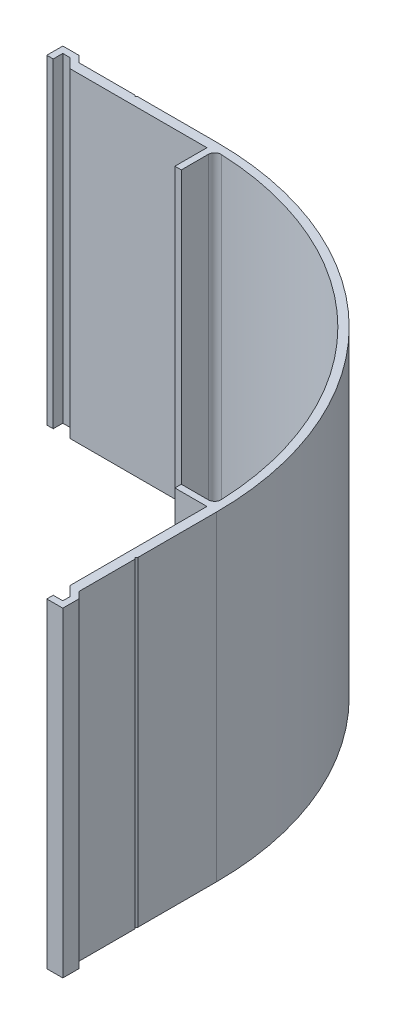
ISO-10303-21;
HEADER;
FILE_DESCRIPTION(('STEP AP214'),'2;1');
FILE_NAME('part.step','',(''),(''),'','','');
FILE_SCHEMA(('AUTOMOTIVE_DESIGN { 1 0 10303 214 1 1 1 1 }'));
ENDSEC;
DATA;
#1=APPLICATION_CONTEXT('core data for automotive mechanical design processes');
#2=APPLICATION_PROTOCOL_DEFINITION('international standard','automotive_design',2000,#1);
#3=PRODUCT_CONTEXT('',#1,'mechanical');
#4=PRODUCT('Part','Part','',(#3));
#5=PRODUCT_RELATED_PRODUCT_CATEGORY('part','',(#4));
#6=PRODUCT_DEFINITION_FORMATION('','',#4);
#7=PRODUCT_DEFINITION_CONTEXT('part definition',#1,'design');
#8=PRODUCT_DEFINITION('design','',#6,#7);
#9=PRODUCT_DEFINITION_SHAPE('','',#8);
#10=(LENGTH_UNIT() NAMED_UNIT(*) SI_UNIT(.MILLI.,.METRE.));
#11=(NAMED_UNIT(*) PLANE_ANGLE_UNIT() SI_UNIT($,.RADIAN.));
#12=(NAMED_UNIT(*) SI_UNIT($,.STERADIAN.) SOLID_ANGLE_UNIT());
#13=UNCERTAINTY_MEASURE_WITH_UNIT(LENGTH_MEASURE(1.E-05),#10,'distance_accuracy_value','');
#14=(GEOMETRIC_REPRESENTATION_CONTEXT(3) GLOBAL_UNCERTAINTY_ASSIGNED_CONTEXT((#13)) GLOBAL_UNIT_ASSIGNED_CONTEXT((#10,
#11,#12)) REPRESENTATION_CONTEXT('',''));
#15=CARTESIAN_POINT('',(0.,0.,0.));
#16=DIRECTION('',(0.,0.,1.));
#17=DIRECTION('',(1.,0.,0.));
#18=AXIS2_PLACEMENT_3D('',#15,#16,#17);
#19=CARTESIAN_POINT('',(-5.49256820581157E-12,50.,-1.99999999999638));
#20=DIRECTION('',(1.,0.,0.));
#21=DIRECTION('',(0.,0.,-1.));
#22=AXIS2_PLACEMENT_3D('',#19,#20,#21);
#23=PLANE('',#22);
#24=DIRECTION('',(0.,0.,1.));
#25=VECTOR('',#24,1.);
#26=CARTESIAN_POINT('',(-5.49256820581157E-12,-50.,-1.99999999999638));
#27=LINE('',#26,#25);
#28=CARTESIAN_POINT('',(-5.49256820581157E-12,-50.,-1.99999999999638));
#29=VERTEX_POINT('',#28);
#30=CARTESIAN_POINT('',(-5.49256820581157E-12,-50.,3.61979868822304E-12));
#31=VERTEX_POINT('',#30);
#32=EDGE_CURVE('E286',#29,#31,#27,.T.);
#33=ORIENTED_EDGE('',*,*,#32,.T.);
#34=DIRECTION('',(0.,-1.,0.));
#35=VECTOR('',#34,1.);
#36=CARTESIAN_POINT('',(-5.49256820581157E-12,50.,3.61979868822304E-12));
#37=LINE('',#36,#35);
#38=CARTESIAN_POINT('',(-5.49256820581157E-12,50.,3.61979868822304E-12));
#39=VERTEX_POINT('',#38);
#40=EDGE_CURVE('E11',#39,#31,#37,.T.);
#41=ORIENTED_EDGE('',*,*,#40,.F.);
#42=DIRECTION('',(0.,0.,1.));
#43=VECTOR('',#42,1.);
#44=CARTESIAN_POINT('',(-5.49256820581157E-12,50.,-1.99999999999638));
#45=LINE('',#44,#43);
#46=CARTESIAN_POINT('',(-5.49256820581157E-12,50.,-1.99999999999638));
#47=VERTEX_POINT('',#46);
#48=EDGE_CURVE('E352',#47,#39,#45,.T.);
#49=ORIENTED_EDGE('',*,*,#48,.F.);
#50=DIRECTION('',(0.,-1.,0.));
#51=VECTOR('',#50,1.);
#52=CARTESIAN_POINT('',(-5.49256820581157E-12,50.,-1.99999999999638));
#53=LINE('',#52,#51);
#54=EDGE_CURVE('E282',#47,#29,#53,.T.);
#55=ORIENTED_EDGE('',*,*,#54,.T.);
#56=EDGE_LOOP('',(#33,#41,#49,#55));
#57=FACE_BOUND('',#56,.T.);
#58=ADVANCED_FACE('F34',(#57),#23,.F.);
#59=CARTESIAN_POINT('',(4.99999999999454,50.,3.61979868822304E-12));
#60=DIRECTION('',(0.,0.,-1.));
#61=DIRECTION('',(-1.,0.,0.));
#62=AXIS2_PLACEMENT_3D('',#59,#60,#61);
#63=PLANE('',#62);
#64=DIRECTION('',(1.,0.,0.));
#65=VECTOR('',#64,1.);
#66=CARTESIAN_POINT('',(4.99999999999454,-50.,3.61979868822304E-12));
#67=LINE('',#66,#65);
#68=CARTESIAN_POINT('',(4.99999999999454,-50.,3.61979868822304E-12));
#69=VERTEX_POINT('',#68);
#70=EDGE_CURVE('E289',#31,#69,#67,.T.);
#71=ORIENTED_EDGE('',*,*,#70,.T.);
#72=DIRECTION('',(0.,-1.,0.));
#73=VECTOR('',#72,1.);
#74=CARTESIAN_POINT('',(4.99999999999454,50.,3.61979868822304E-12));
#75=LINE('',#74,#73);
#76=CARTESIAN_POINT('',(4.99999999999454,50.,3.61979868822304E-12));
#77=VERTEX_POINT('',#76);
#78=EDGE_CURVE('E42',#77,#69,#75,.T.);
#79=ORIENTED_EDGE('',*,*,#78,.F.);
#80=DIRECTION('',(1.,0.,0.));
#81=VECTOR('',#80,1.);
#82=CARTESIAN_POINT('',(4.99999999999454,50.,3.61979868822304E-12));
#83=LINE('',#82,#81);
#84=EDGE_CURVE('E171',#39,#77,#83,.T.);
#85=ORIENTED_EDGE('',*,*,#84,.F.);
#86=ORIENTED_EDGE('',*,*,#40,.T.);
#87=EDGE_LOOP('',(#71,#79,#85,#86));
#88=FACE_BOUND('',#87,.T.);
#89=ADVANCED_FACE('F540',(#88),#63,.F.);
#90=CARTESIAN_POINT('',(4.99999999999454,50.,-5.00000000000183));
#91=DIRECTION('',(-1.,0.,0.));
#92=DIRECTION('',(0.,0.,1.));
#93=AXIS2_PLACEMENT_3D('',#90,#91,#92);
#94=PLANE('',#93);
#95=DIRECTION('',(0.,0.,-1.));
#96=VECTOR('',#95,1.);
#97=CARTESIAN_POINT('',(4.99999999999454,-50.,-5.00000000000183));
#98=LINE('',#97,#96);
#99=CARTESIAN_POINT('',(4.99999999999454,-50.,-5.00000000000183));
#100=VERTEX_POINT('',#99);
#101=EDGE_CURVE('E291',#69,#100,#98,.T.);
#102=ORIENTED_EDGE('',*,*,#101,.T.);
#103=DIRECTION('',(0.,-1.,0.));
#104=VECTOR('',#103,1.);
#105=CARTESIAN_POINT('',(4.99999999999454,50.,-5.00000000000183));
#106=LINE('',#105,#104);
#107=CARTESIAN_POINT('',(4.99999999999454,50.,-5.00000000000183));
#108=VERTEX_POINT('',#107);
#109=EDGE_CURVE('E437',#108,#100,#106,.T.);
#110=ORIENTED_EDGE('',*,*,#109,.F.);
#111=DIRECTION('',(0.,0.,-1.));
#112=VECTOR('',#111,1.);
#113=CARTESIAN_POINT('',(4.99999999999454,50.,-5.00000000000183));
#114=LINE('',#113,#112);
#115=EDGE_CURVE('E445',#77,#108,#114,.T.);
#116=ORIENTED_EDGE('',*,*,#115,.F.);
#117=ORIENTED_EDGE('',*,*,#78,.T.);
#118=EDGE_LOOP('',(#102,#110,#116,#117));
#119=FACE_BOUND('',#118,.T.);
#120=ADVANCED_FACE('F443',(#119),#94,.F.);
#121=CARTESIAN_POINT('',(2.99999999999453,50.,-7.00000000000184));
#122=DIRECTION('',(-0.707106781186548,0.,0.707106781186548));
#123=DIRECTION('',(0.707106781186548,0.,0.707106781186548));
#124=AXIS2_PLACEMENT_3D('',#121,#122,#123);
#125=PLANE('',#124);
#126=DIRECTION('',(-0.707106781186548,0.,-0.707106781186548));
#127=VECTOR('',#126,1.);
#128=CARTESIAN_POINT('',(2.99999999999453,-50.,-7.00000000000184));
#129=LINE('',#128,#127);
#130=CARTESIAN_POINT('',(2.99999999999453,-50.,-7.00000000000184));
#131=VERTEX_POINT('',#130);
#132=EDGE_CURVE('E293',#100,#131,#129,.T.);
#133=ORIENTED_EDGE('',*,*,#132,.T.);
#134=DIRECTION('',(0.,-1.,0.));
#135=VECTOR('',#134,1.);
#136=CARTESIAN_POINT('',(2.99999999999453,50.,-7.00000000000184));
#137=LINE('',#136,#135);
#138=CARTESIAN_POINT('',(2.99999999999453,50.,-7.00000000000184));
#139=VERTEX_POINT('',#138);
#140=EDGE_CURVE('E434',#139,#131,#137,.T.);
#141=ORIENTED_EDGE('',*,*,#140,.F.);
#142=DIRECTION('',(-0.707106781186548,0.,-0.707106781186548));
#143=VECTOR('',#142,1.);
#144=CARTESIAN_POINT('',(2.99999999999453,50.,-7.00000000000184));
#145=LINE('',#144,#143);
#146=EDGE_CURVE('E463',#108,#139,#145,.T.);
#147=ORIENTED_EDGE('',*,*,#146,.F.);
#148=ORIENTED_EDGE('',*,*,#109,.T.);
#149=EDGE_LOOP('',(#133,#141,#147,#148));
#150=FACE_BOUND('',#149,.T.);
#151=ADVANCED_FACE('F454',(#150),#125,.F.);
#152=CARTESIAN_POINT('',(2.99999999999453,50.,-24.6000000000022));
#153=DIRECTION('',(-1.,0.,0.));
#154=DIRECTION('',(0.,0.,1.));
#155=AXIS2_PLACEMENT_3D('',#152,#153,#154);
#156=PLANE('',#155);
#157=DIRECTION('',(0.,0.,-1.));
#158=VECTOR('',#157,1.);
#159=CARTESIAN_POINT('',(2.99999999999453,-50.,-24.6000000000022));
#160=LINE('',#159,#158);
#161=CARTESIAN_POINT('',(2.99999999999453,-50.,-24.6000000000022));
#162=VERTEX_POINT('',#161);
#163=EDGE_CURVE('E295',#131,#162,#160,.T.);
#164=ORIENTED_EDGE('',*,*,#163,.T.);
#165=DIRECTION('',(0.,-1.,0.));
#166=VECTOR('',#165,1.);
#167=CARTESIAN_POINT('',(2.99999999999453,50.,-24.6000000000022));
#168=LINE('',#167,#166);
#169=CARTESIAN_POINT('',(2.99999999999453,50.,-24.6000000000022));
#170=VERTEX_POINT('',#169);
#171=EDGE_CURVE('E431',#170,#162,#168,.T.);
#172=ORIENTED_EDGE('',*,*,#171,.F.);
#173=DIRECTION('',(0.,0.,-1.));
#174=VECTOR('',#173,1.);
#175=CARTESIAN_POINT('',(2.99999999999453,50.,-24.6000000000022));
#176=LINE('',#175,#174);
#177=EDGE_CURVE('E460',#139,#170,#176,.T.);
#178=ORIENTED_EDGE('',*,*,#177,.F.);
#179=ORIENTED_EDGE('',*,*,#140,.T.);
#180=EDGE_LOOP('',(#164,#172,#178,#179));
#181=FACE_BOUND('',#180,.T.);
#182=ADVANCED_FACE('F458',(#181),#156,.F.);
#183=CARTESIAN_POINT('',(2.99999999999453,50.,-24.6000000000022));
#184=DIRECTION('',(-0.707106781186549,0.,0.707106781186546));
#185=DIRECTION('',(0.707106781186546,0.,0.707106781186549));
#186=AXIS2_PLACEMENT_3D('',#183,#184,#185);
#187=PLANE('',#186);
#188=DIRECTION('',(-0.707106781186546,0.,-0.707106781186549));
#189=VECTOR('',#188,1.);
#190=CARTESIAN_POINT('',(2.99999999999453,-50.,-24.6000000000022));
#191=LINE('',#190,#189);
#192=CARTESIAN_POINT('',(2.59999999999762,-50.,-24.9999999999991));
#193=VERTEX_POINT('',#192);
#194=EDGE_CURVE('E297',#162,#193,#191,.T.);
#195=ORIENTED_EDGE('',*,*,#194,.T.);
#196=DIRECTION('',(0.,-1.,0.));
#197=VECTOR('',#196,1.);
#198=CARTESIAN_POINT('',(2.59999999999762,50.,-24.9999999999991));
#199=LINE('',#198,#197);
#200=CARTESIAN_POINT('',(2.59999999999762,50.,-24.9999999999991));
#201=VERTEX_POINT('',#200);
#202=EDGE_CURVE('E428',#201,#193,#199,.T.);
#203=ORIENTED_EDGE('',*,*,#202,.F.);
#204=DIRECTION('',(-0.707106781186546,0.,-0.707106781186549));
#205=VECTOR('',#204,1.);
#206=CARTESIAN_POINT('',(2.99999999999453,50.,-24.6000000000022));
#207=LINE('',#206,#205);
#208=EDGE_CURVE('E462',#170,#201,#207,.T.);
#209=ORIENTED_EDGE('',*,*,#208,.F.);
#210=ORIENTED_EDGE('',*,*,#171,.T.);
#211=EDGE_LOOP('',(#195,#203,#209,#210));
#212=FACE_BOUND('',#211,.T.);
#213=ADVANCED_FACE('F553',(#212),#187,.F.);
#214=CARTESIAN_POINT('',(2.59999999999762,50.,-24.9999999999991));
#215=DIRECTION('',(-0.707106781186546,0.,-0.707106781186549));
#216=DIRECTION('',(-0.707106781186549,0.,0.707106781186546));
#217=AXIS2_PLACEMENT_3D('',#214,#215,#216);
#218=PLANE('',#217);
#219=DIRECTION('',(0.707106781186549,0.,-0.707106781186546));
#220=VECTOR('',#219,1.);
#221=CARTESIAN_POINT('',(2.59999999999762,-50.,-24.9999999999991));
#222=LINE('',#221,#220);
#223=CARTESIAN_POINT('',(2.99999999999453,-50.,-25.399999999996));
#224=VERTEX_POINT('',#223);
#225=EDGE_CURVE('E299',#193,#224,#222,.T.);
#226=ORIENTED_EDGE('',*,*,#225,.T.);
#227=DIRECTION('',(0.,-1.,0.));
#228=VECTOR('',#227,1.);
#229=CARTESIAN_POINT('',(2.99999999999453,50.,-25.399999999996));
#230=LINE('',#229,#228);
#231=CARTESIAN_POINT('',(2.99999999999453,50.,-25.399999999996));
#232=VERTEX_POINT('',#231);
#233=EDGE_CURVE('E425',#232,#224,#230,.T.);
#234=ORIENTED_EDGE('',*,*,#233,.F.);
#235=DIRECTION('',(0.707106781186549,0.,-0.707106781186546));
#236=VECTOR('',#235,1.);
#237=CARTESIAN_POINT('',(2.59999999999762,50.,-24.9999999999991));
#238=LINE('',#237,#236);
#239=EDGE_CURVE('E465',#201,#232,#238,.T.);
#240=ORIENTED_EDGE('',*,*,#239,.F.);
#241=ORIENTED_EDGE('',*,*,#202,.T.);
#242=EDGE_LOOP('',(#226,#234,#240,#241));
#243=FACE_BOUND('',#242,.T.);
#244=ADVANCED_FACE('F556',(#243),#218,.F.);
#245=CARTESIAN_POINT('',(2.99999999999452,50.,-49.9999999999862));
#246=DIRECTION('',(-1.,0.,0.));
#247=DIRECTION('',(0.,0.,1.));
#248=AXIS2_PLACEMENT_3D('',#245,#246,#247);
#249=PLANE('',#248);
#250=DIRECTION('',(0.,0.,-1.));
#251=VECTOR('',#250,1.);
#252=CARTESIAN_POINT('',(2.99999999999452,-50.,-49.9999999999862));
#253=LINE('',#252,#251);
#254=CARTESIAN_POINT('',(2.99999999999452,-50.,-49.9999999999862));
#255=VERTEX_POINT('',#254);
#256=EDGE_CURVE('E301',#224,#255,#253,.T.);
#257=ORIENTED_EDGE('',*,*,#256,.T.);
#258=DIRECTION('',(0.,-1.,0.));
#259=VECTOR('',#258,1.);
#260=CARTESIAN_POINT('',(2.99999999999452,50.,-49.9999999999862));
#261=LINE('',#260,#259);
#262=CARTESIAN_POINT('',(2.99999999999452,50.,-49.9999999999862));
#263=VERTEX_POINT('',#262);
#264=EDGE_CURVE('E422',#263,#255,#261,.T.);
#265=ORIENTED_EDGE('',*,*,#264,.F.);
#266=DIRECTION('',(0.,0.,-1.));
#267=VECTOR('',#266,1.);
#268=CARTESIAN_POINT('',(2.99999999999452,50.,-49.9999999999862));
#269=LINE('',#268,#267);
#270=EDGE_CURVE('E471',#232,#263,#269,.T.);
#271=ORIENTED_EDGE('',*,*,#270,.F.);
#272=ORIENTED_EDGE('',*,*,#233,.T.);
#273=EDGE_LOOP('',(#257,#265,#271,#272));
#274=FACE_BOUND('',#273,.T.);
#275=ADVANCED_FACE('F560',(#274),#249,.F.);
#276=CARTESIAN_POINT('',(-97.0000000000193,50.,-49.9999999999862));
#277=DIRECTION('',(0.,-1.,0.));
#278=DIRECTION('',(0.,0.,-1.));
#279=AXIS2_PLACEMENT_3D('',#276,#277,#278);
#280=CYLINDRICAL_SURFACE('',#279,100.000000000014);
#281=CARTESIAN_POINT('',(-97.0000000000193,-50.,-49.9999999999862));
#282=DIRECTION('',(0.,1.,0.));
#283=DIRECTION('',(0.,0.,1.));
#284=AXIS2_PLACEMENT_3D('',#281,#282,#283);
#285=CIRCLE('',#284,100.000000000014);
#286=CARTESIAN_POINT('',(-97.0000000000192,-50.,-150.));
#287=VERTEX_POINT('',#286);
#288=EDGE_CURVE('E303',#255,#287,#285,.T.);
#289=ORIENTED_EDGE('',*,*,#288,.T.);
#290=DIRECTION('',(0.,-1.,0.));
#291=VECTOR('',#290,1.);
#292=CARTESIAN_POINT('',(-97.0000000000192,50.,-150.));
#293=LINE('',#292,#291);
#294=CARTESIAN_POINT('',(-97.0000000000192,50.,-150.));
#295=VERTEX_POINT('',#294);
#296=EDGE_CURVE('E419',#295,#287,#293,.T.);
#297=ORIENTED_EDGE('',*,*,#296,.F.);
#298=CARTESIAN_POINT('',(-97.0000000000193,50.,-49.9999999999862));
#299=DIRECTION('',(0.,1.,0.));
#300=DIRECTION('',(0.,0.,1.));
#301=AXIS2_PLACEMENT_3D('',#298,#299,#300);
#302=CIRCLE('',#301,100.000000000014);
#303=EDGE_CURVE('E473',#263,#295,#302,.T.);
#304=ORIENTED_EDGE('',*,*,#303,.F.);
#305=ORIENTED_EDGE('',*,*,#264,.T.);
#306=EDGE_LOOP('',(#289,#297,#304,#305));
#307=FACE_BOUND('',#306,.T.);
#308=ADVANCED_FACE('F564',(#307),#280,.T.);
#309=CARTESIAN_POINT('',(-121.600000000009,50.,-150.));
#310=DIRECTION('',(0.,0.,1.));
#311=DIRECTION('',(1.,0.,0.));
#312=AXIS2_PLACEMENT_3D('',#309,#310,#311);
#313=PLANE('',#312);
#314=DIRECTION('',(-1.,0.,0.));
#315=VECTOR('',#314,1.);
#316=CARTESIAN_POINT('',(-121.600000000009,-50.,-150.));
#317=LINE('',#316,#315);
#318=CARTESIAN_POINT('',(-121.600000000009,-50.,-150.));
#319=VERTEX_POINT('',#318);
#320=EDGE_CURVE('E305',#287,#319,#317,.T.);
#321=ORIENTED_EDGE('',*,*,#320,.T.);
#322=DIRECTION('',(0.,-1.,0.));
#323=VECTOR('',#322,1.);
#324=CARTESIAN_POINT('',(-121.600000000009,50.,-150.));
#325=LINE('',#324,#323);
#326=CARTESIAN_POINT('',(-121.600000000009,50.,-150.));
#327=VERTEX_POINT('',#326);
#328=EDGE_CURVE('E416',#327,#319,#325,.T.);
#329=ORIENTED_EDGE('',*,*,#328,.F.);
#330=DIRECTION('',(-1.,0.,0.));
#331=VECTOR('',#330,1.);
#332=CARTESIAN_POINT('',(-121.600000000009,50.,-150.));
#333=LINE('',#332,#331);
#334=EDGE_CURVE('E475',#295,#327,#333,.T.);
#335=ORIENTED_EDGE('',*,*,#334,.F.);
#336=ORIENTED_EDGE('',*,*,#296,.T.);
#337=EDGE_LOOP('',(#321,#329,#335,#336));
#338=FACE_BOUND('',#337,.T.);
#339=ADVANCED_FACE('F568',(#338),#313,.F.);
#340=CARTESIAN_POINT('',(-121.600000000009,50.,-150.));
#341=DIRECTION('',(0.707106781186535,0.,0.70710678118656));
#342=DIRECTION('',(0.70710678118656,0.,-0.707106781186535));
#343=AXIS2_PLACEMENT_3D('',#340,#341,#342);
#344=PLANE('',#343);
#345=DIRECTION('',(-0.70710678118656,0.,0.707106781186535));
#346=VECTOR('',#345,1.);
#347=CARTESIAN_POINT('',(-121.600000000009,-50.,-150.));
#348=LINE('',#347,#346);
#349=CARTESIAN_POINT('',(-122.000000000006,-50.,-149.600000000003));
#350=VERTEX_POINT('',#349);
#351=EDGE_CURVE('E307',#319,#350,#348,.T.);
#352=ORIENTED_EDGE('',*,*,#351,.T.);
#353=DIRECTION('',(0.,-1.,0.));
#354=VECTOR('',#353,1.);
#355=CARTESIAN_POINT('',(-122.000000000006,50.,-149.600000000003));
#356=LINE('',#355,#354);
#357=CARTESIAN_POINT('',(-122.000000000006,50.,-149.600000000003));
#358=VERTEX_POINT('',#357);
#359=EDGE_CURVE('E413',#358,#350,#356,.T.);
#360=ORIENTED_EDGE('',*,*,#359,.F.);
#361=DIRECTION('',(-0.70710678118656,0.,0.707106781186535));
#362=VECTOR('',#361,1.);
#363=CARTESIAN_POINT('',(-121.600000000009,50.,-150.));
#364=LINE('',#363,#362);
#365=EDGE_CURVE('E477',#327,#358,#364,.T.);
#366=ORIENTED_EDGE('',*,*,#365,.F.);
#367=ORIENTED_EDGE('',*,*,#328,.T.);
#368=EDGE_LOOP('',(#352,#360,#366,#367));
#369=FACE_BOUND('',#368,.T.);
#370=ADVANCED_FACE('F572',(#369),#344,.F.);
#371=CARTESIAN_POINT('',(-122.000000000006,50.,-149.600000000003));
#372=DIRECTION('',(-0.707106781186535,0.,0.70710678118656));
#373=DIRECTION('',(0.70710678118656,0.,0.707106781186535));
#374=AXIS2_PLACEMENT_3D('',#371,#372,#373);
#375=PLANE('',#374);
#376=DIRECTION('',(-0.70710678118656,0.,-0.707106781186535));
#377=VECTOR('',#376,1.);
#378=CARTESIAN_POINT('',(-122.000000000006,-50.,-149.600000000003));
#379=LINE('',#378,#377);
#380=CARTESIAN_POINT('',(-122.400000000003,-50.,-150.));
#381=VERTEX_POINT('',#380);
#382=EDGE_CURVE('E309',#350,#381,#379,.T.);
#383=ORIENTED_EDGE('',*,*,#382,.T.);
#384=DIRECTION('',(0.,-1.,0.));
#385=VECTOR('',#384,1.);
#386=CARTESIAN_POINT('',(-122.400000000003,50.,-150.));
#387=LINE('',#386,#385);
#388=CARTESIAN_POINT('',(-122.400000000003,50.,-150.));
#389=VERTEX_POINT('',#388);
#390=EDGE_CURVE('E410',#389,#381,#387,.T.);
#391=ORIENTED_EDGE('',*,*,#390,.F.);
#392=DIRECTION('',(-0.70710678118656,0.,-0.707106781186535));
#393=VECTOR('',#392,1.);
#394=CARTESIAN_POINT('',(-122.000000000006,50.,-149.600000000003));
#395=LINE('',#394,#393);
#396=EDGE_CURVE('E479',#358,#389,#395,.T.);
#397=ORIENTED_EDGE('',*,*,#396,.F.);
#398=ORIENTED_EDGE('',*,*,#359,.T.);
#399=EDGE_LOOP('',(#383,#391,#397,#398));
#400=FACE_BOUND('',#399,.T.);
#401=ADVANCED_FACE('F576',(#400),#375,.F.);
#402=CARTESIAN_POINT('',(-140.000000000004,50.,-150.));
#403=DIRECTION('',(0.,0.,1.));
#404=DIRECTION('',(1.,0.,0.));
#405=AXIS2_PLACEMENT_3D('',#402,#403,#404);
#406=PLANE('',#405);
#407=DIRECTION('',(-1.,0.,0.));
#408=VECTOR('',#407,1.);
#409=CARTESIAN_POINT('',(-140.000000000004,-50.,-150.));
#410=LINE('',#409,#408);
#411=CARTESIAN_POINT('',(-140.000000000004,-50.,-150.));
#412=VERTEX_POINT('',#411);
#413=EDGE_CURVE('E311',#381,#412,#410,.T.);
#414=ORIENTED_EDGE('',*,*,#413,.T.);
#415=DIRECTION('',(0.,-1.,0.));
#416=VECTOR('',#415,1.);
#417=CARTESIAN_POINT('',(-140.000000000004,50.,-150.));
#418=LINE('',#417,#416);
#419=CARTESIAN_POINT('',(-140.000000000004,50.,-150.));
#420=VERTEX_POINT('',#419);
#421=EDGE_CURVE('E407',#420,#412,#418,.T.);
#422=ORIENTED_EDGE('',*,*,#421,.F.);
#423=DIRECTION('',(-1.,0.,0.));
#424=VECTOR('',#423,1.);
#425=CARTESIAN_POINT('',(-140.000000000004,50.,-150.));
#426=LINE('',#425,#424);
#427=EDGE_CURVE('E481',#389,#420,#426,.T.);
#428=ORIENTED_EDGE('',*,*,#427,.F.);
#429=ORIENTED_EDGE('',*,*,#390,.T.);
#430=EDGE_LOOP('',(#414,#422,#428,#429));
#431=FACE_BOUND('',#430,.T.);
#432=ADVANCED_FACE('F580',(#431),#406,.F.);
#433=CARTESIAN_POINT('',(-142.000000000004,50.,-152.));
#434=DIRECTION('',(-0.707106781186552,0.,0.707106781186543));
#435=DIRECTION('',(0.707106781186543,0.,0.707106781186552));
#436=AXIS2_PLACEMENT_3D('',#433,#434,#435);
#437=PLANE('',#436);
#438=DIRECTION('',(-0.707106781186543,0.,-0.707106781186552));
#439=VECTOR('',#438,1.);
#440=CARTESIAN_POINT('',(-142.000000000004,-50.,-152.));
#441=LINE('',#440,#439);
#442=CARTESIAN_POINT('',(-142.000000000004,-50.,-152.));
#443=VERTEX_POINT('',#442);
#444=EDGE_CURVE('E313',#412,#443,#441,.T.);
#445=ORIENTED_EDGE('',*,*,#444,.T.);
#446=DIRECTION('',(0.,-1.,0.));
#447=VECTOR('',#446,1.);
#448=CARTESIAN_POINT('',(-142.000000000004,50.,-152.));
#449=LINE('',#448,#447);
#450=CARTESIAN_POINT('',(-142.000000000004,50.,-152.));
#451=VERTEX_POINT('',#450);
#452=EDGE_CURVE('E404',#451,#443,#449,.T.);
#453=ORIENTED_EDGE('',*,*,#452,.F.);
#454=DIRECTION('',(-0.707106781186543,0.,-0.707106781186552));
#455=VECTOR('',#454,1.);
#456=CARTESIAN_POINT('',(-142.000000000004,50.,-152.));
#457=LINE('',#456,#455);
#458=EDGE_CURVE('E483',#420,#451,#457,.T.);
#459=ORIENTED_EDGE('',*,*,#458,.F.);
#460=ORIENTED_EDGE('',*,*,#421,.T.);
#461=EDGE_LOOP('',(#445,#453,#459,#460));
#462=FACE_BOUND('',#461,.T.);
#463=ADVANCED_FACE('F584',(#462),#437,.F.);
#464=CARTESIAN_POINT('',(-147.000000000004,50.,-152.));
#465=DIRECTION('',(0.,0.,1.));
#466=DIRECTION('',(1.,0.,0.));
#467=AXIS2_PLACEMENT_3D('',#464,#465,#466);
#468=PLANE('',#467);
#469=DIRECTION('',(-1.,0.,0.));
#470=VECTOR('',#469,1.);
#471=CARTESIAN_POINT('',(-147.000000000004,-50.,-152.));
#472=LINE('',#471,#470);
#473=CARTESIAN_POINT('',(-147.000000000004,-50.,-152.));
#474=VERTEX_POINT('',#473);
#475=EDGE_CURVE('E315',#443,#474,#472,.T.);
#476=ORIENTED_EDGE('',*,*,#475,.T.);
#477=DIRECTION('',(0.,-1.,0.));
#478=VECTOR('',#477,1.);
#479=CARTESIAN_POINT('',(-147.000000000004,50.,-152.));
#480=LINE('',#479,#478);
#481=CARTESIAN_POINT('',(-147.000000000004,50.,-152.));
#482=VERTEX_POINT('',#481);
#483=EDGE_CURVE('E401',#482,#474,#480,.T.);
#484=ORIENTED_EDGE('',*,*,#483,.F.);
#485=DIRECTION('',(-1.,0.,0.));
#486=VECTOR('',#485,1.);
#487=CARTESIAN_POINT('',(-147.000000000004,50.,-152.));
#488=LINE('',#487,#486);
#489=EDGE_CURVE('E485',#451,#482,#488,.T.);
#490=ORIENTED_EDGE('',*,*,#489,.F.);
#491=ORIENTED_EDGE('',*,*,#452,.T.);
#492=EDGE_LOOP('',(#476,#484,#490,#491));
#493=FACE_BOUND('',#492,.T.);
#494=ADVANCED_FACE('F588',(#493),#468,.F.);
#495=CARTESIAN_POINT('',(-147.000000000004,50.,-147.000000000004));
#496=DIRECTION('',(1.,0.,0.));
#497=DIRECTION('',(0.,0.,-1.));
#498=AXIS2_PLACEMENT_3D('',#495,#496,#497);
#499=PLANE('',#498);
#500=DIRECTION('',(0.,0.,1.));
#501=VECTOR('',#500,1.);
#502=CARTESIAN_POINT('',(-147.000000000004,-50.,-147.000000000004));
#503=LINE('',#502,#501);
#504=CARTESIAN_POINT('',(-147.000000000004,-50.,-147.000000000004));
#505=VERTEX_POINT('',#504);
#506=EDGE_CURVE('E317',#474,#505,#503,.T.);
#507=ORIENTED_EDGE('',*,*,#506,.T.);
#508=DIRECTION('',(0.,-1.,0.));
#509=VECTOR('',#508,1.);
#510=CARTESIAN_POINT('',(-147.000000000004,50.,-147.000000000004));
#511=LINE('',#510,#509);
#512=CARTESIAN_POINT('',(-147.000000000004,50.,-147.000000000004));
#513=VERTEX_POINT('',#512);
#514=EDGE_CURVE('E398',#513,#505,#511,.T.);
#515=ORIENTED_EDGE('',*,*,#514,.F.);
#516=DIRECTION('',(0.,0.,1.));
#517=VECTOR('',#516,1.);
#518=CARTESIAN_POINT('',(-147.000000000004,50.,-147.000000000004));
#519=LINE('',#518,#517);
#520=EDGE_CURVE('E487',#482,#513,#519,.T.);
#521=ORIENTED_EDGE('',*,*,#520,.F.);
#522=ORIENTED_EDGE('',*,*,#483,.T.);
#523=EDGE_LOOP('',(#507,#515,#521,#522));
#524=FACE_BOUND('',#523,.T.);
#525=ADVANCED_FACE('F592',(#524),#499,.F.);
#526=CARTESIAN_POINT('',(-147.000000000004,50.,-147.000000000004));
#527=DIRECTION('',(0.,0.,-1.));
#528=DIRECTION('',(-1.,0.,0.));
#529=AXIS2_PLACEMENT_3D('',#526,#527,#528);
#530=PLANE('',#529);
#531=DIRECTION('',(1.,0.,0.));
#532=VECTOR('',#531,1.);
#533=CARTESIAN_POINT('',(-147.000000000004,-50.,-147.000000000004));
#534=LINE('',#533,#532);
#535=CARTESIAN_POINT('',(-145.000000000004,-50.,-147.000000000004));
#536=VERTEX_POINT('',#535);
#537=EDGE_CURVE('E319',#505,#536,#534,.T.);
#538=ORIENTED_EDGE('',*,*,#537,.T.);
#539=DIRECTION('',(0.,-1.,0.));
#540=VECTOR('',#539,1.);
#541=CARTESIAN_POINT('',(-145.000000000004,50.,-147.000000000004));
#542=LINE('',#541,#540);
#543=CARTESIAN_POINT('',(-145.000000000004,50.,-147.000000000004));
#544=VERTEX_POINT('',#543);
#545=EDGE_CURVE('E395',#544,#536,#542,.T.);
#546=ORIENTED_EDGE('',*,*,#545,.F.);
#547=DIRECTION('',(1.,0.,0.));
#548=VECTOR('',#547,1.);
#549=CARTESIAN_POINT('',(-147.000000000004,50.,-147.000000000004));
#550=LINE('',#549,#548);
#551=EDGE_CURVE('E489',#513,#544,#550,.T.);
#552=ORIENTED_EDGE('',*,*,#551,.F.);
#553=ORIENTED_EDGE('',*,*,#514,.T.);
#554=EDGE_LOOP('',(#538,#546,#552,#553));
#555=FACE_BOUND('',#554,.T.);
#556=ADVANCED_FACE('F596',(#555),#530,.F.);
#557=CARTESIAN_POINT('',(-145.000000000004,50.,-147.000000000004));
#558=DIRECTION('',(-1.,0.,0.));
#559=DIRECTION('',(0.,0.,1.));
#560=AXIS2_PLACEMENT_3D('',#557,#558,#559);
#561=PLANE('',#560);
#562=DIRECTION('',(0.,0.,-1.));
#563=VECTOR('',#562,1.);
#564=CARTESIAN_POINT('',(-145.000000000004,-50.,-147.000000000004));
#565=LINE('',#564,#563);
#566=CARTESIAN_POINT('',(-145.000000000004,-50.,-150.));
#567=VERTEX_POINT('',#566);
#568=EDGE_CURVE('E321',#536,#567,#565,.T.);
#569=ORIENTED_EDGE('',*,*,#568,.T.);
#570=DIRECTION('',(0.,-1.,0.));
#571=VECTOR('',#570,1.);
#572=CARTESIAN_POINT('',(-145.000000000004,50.,-150.));
#573=LINE('',#572,#571);
#574=CARTESIAN_POINT('',(-145.000000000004,50.,-150.));
#575=VERTEX_POINT('',#574);
#576=EDGE_CURVE('E392',#575,#567,#573,.T.);
#577=ORIENTED_EDGE('',*,*,#576,.F.);
#578=DIRECTION('',(0.,0.,-1.));
#579=VECTOR('',#578,1.);
#580=CARTESIAN_POINT('',(-145.000000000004,50.,-147.000000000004));
#581=LINE('',#580,#579);
#582=EDGE_CURVE('E491',#544,#575,#581,.T.);
#583=ORIENTED_EDGE('',*,*,#582,.F.);
#584=ORIENTED_EDGE('',*,*,#545,.T.);
#585=EDGE_LOOP('',(#569,#577,#583,#584));
#586=FACE_BOUND('',#585,.T.);
#587=ADVANCED_FACE('F600',(#586),#561,.F.);
#588=CARTESIAN_POINT('',(-145.000000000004,50.,-150.));
#589=DIRECTION('',(0.,0.,-1.));
#590=DIRECTION('',(-1.,0.,0.));
#591=AXIS2_PLACEMENT_3D('',#588,#589,#590);
#592=PLANE('',#591);
#593=DIRECTION('',(1.,0.,0.));
#594=VECTOR('',#593,1.);
#595=CARTESIAN_POINT('',(-145.000000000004,-50.,-150.));
#596=LINE('',#595,#594);
#597=CARTESIAN_POINT('',(-142.828427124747,-50.,-150.));
#598=VERTEX_POINT('',#597);
#599=EDGE_CURVE('E323',#567,#598,#596,.T.);
#600=ORIENTED_EDGE('',*,*,#599,.T.);
#601=DIRECTION('',(0.,-1.,0.));
#602=VECTOR('',#601,1.);
#603=CARTESIAN_POINT('',(-142.828427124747,50.,-150.));
#604=LINE('',#603,#602);
#605=CARTESIAN_POINT('',(-142.828427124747,50.,-150.));
#606=VERTEX_POINT('',#605);
#607=EDGE_CURVE('E389',#606,#598,#604,.T.);
#608=ORIENTED_EDGE('',*,*,#607,.F.);
#609=DIRECTION('',(1.,0.,0.));
#610=VECTOR('',#609,1.);
#611=CARTESIAN_POINT('',(-145.000000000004,50.,-150.));
#612=LINE('',#611,#610);
#613=EDGE_CURVE('E493',#575,#606,#612,.T.);
#614=ORIENTED_EDGE('',*,*,#613,.F.);
#615=ORIENTED_EDGE('',*,*,#576,.T.);
#616=EDGE_LOOP('',(#600,#608,#614,#615));
#617=FACE_BOUND('',#616,.T.);
#618=ADVANCED_FACE('F604',(#617),#592,.F.);
#619=CARTESIAN_POINT('',(-142.828427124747,50.,-150.));
#620=DIRECTION('',(0.707106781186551,0.,-0.707106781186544));
#621=DIRECTION('',(-0.707106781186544,0.,-0.707106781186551));
#622=AXIS2_PLACEMENT_3D('',#619,#620,#621);
#623=PLANE('',#622);
#624=DIRECTION('',(0.707106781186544,0.,0.707106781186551));
#625=VECTOR('',#624,1.);
#626=CARTESIAN_POINT('',(-142.828427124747,-50.,-150.));
#627=LINE('',#626,#625);
#628=CARTESIAN_POINT('',(-139.82842712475,-50.,-147.000000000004));
#629=VERTEX_POINT('',#628);
#630=EDGE_CURVE('E325',#598,#629,#627,.T.);
#631=ORIENTED_EDGE('',*,*,#630,.T.);
#632=DIRECTION('',(0.,-1.,0.));
#633=VECTOR('',#632,1.);
#634=CARTESIAN_POINT('',(-139.82842712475,50.,-147.000000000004));
#635=LINE('',#634,#633);
#636=CARTESIAN_POINT('',(-139.82842712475,50.,-147.000000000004));
#637=VERTEX_POINT('',#636);
#638=EDGE_CURVE('E386',#637,#629,#635,.T.);
#639=ORIENTED_EDGE('',*,*,#638,.F.);
#640=DIRECTION('',(0.707106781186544,0.,0.707106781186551));
#641=VECTOR('',#640,1.);
#642=CARTESIAN_POINT('',(-142.828427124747,50.,-150.));
#643=LINE('',#642,#641);
#644=EDGE_CURVE('E495',#606,#637,#643,.T.);
#645=ORIENTED_EDGE('',*,*,#644,.F.);
#646=ORIENTED_EDGE('',*,*,#607,.T.);
#647=EDGE_LOOP('',(#631,#639,#645,#646));
#648=FACE_BOUND('',#647,.T.);
#649=ADVANCED_FACE('F608',(#648),#623,.F.);
#650=CARTESIAN_POINT('',(-139.82842712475,50.,-147.000000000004));
#651=DIRECTION('',(0.,0.,-1.));
#652=DIRECTION('',(-1.,0.,0.));
#653=AXIS2_PLACEMENT_3D('',#650,#651,#652);
#654=PLANE('',#653);
#655=DIRECTION('',(1.,0.,0.));
#656=VECTOR('',#655,1.);
#657=CARTESIAN_POINT('',(-139.82842712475,-50.,-147.000000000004));
#658=LINE('',#657,#656);
#659=CARTESIAN_POINT('',(-97.0000000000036,-50.,-147.000000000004));
#660=VERTEX_POINT('',#659);
#661=EDGE_CURVE('E327',#629,#660,#658,.T.);
#662=ORIENTED_EDGE('',*,*,#661,.T.);
#663=DIRECTION('',(0.,-1.,0.));
#664=VECTOR('',#663,1.);
#665=CARTESIAN_POINT('',(-97.0000000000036,50.,-147.000000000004));
#666=LINE('',#665,#664);
#667=CARTESIAN_POINT('',(-97.0000000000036,50.,-147.000000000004));
#668=VERTEX_POINT('',#667);
#669=EDGE_CURVE('E383',#668,#660,#666,.T.);
#670=ORIENTED_EDGE('',*,*,#669,.F.);
#671=DIRECTION('',(1.,0.,0.));
#672=VECTOR('',#671,1.);
#673=CARTESIAN_POINT('',(-139.82842712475,50.,-147.000000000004));
#674=LINE('',#673,#672);
#675=EDGE_CURVE('E497',#637,#668,#674,.T.);
#676=ORIENTED_EDGE('',*,*,#675,.F.);
#677=ORIENTED_EDGE('',*,*,#638,.T.);
#678=EDGE_LOOP('',(#662,#670,#676,#677));
#679=FACE_BOUND('',#678,.T.);
#680=ADVANCED_FACE('F612',(#679),#654,.F.);
#681=CARTESIAN_POINT('',(-97.0000000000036,50.,-147.000000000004));
#682=DIRECTION('',(1.,0.,0.));
#683=DIRECTION('',(0.,0.,-1.));
#684=AXIS2_PLACEMENT_3D('',#681,#682,#683);
#685=PLANE('',#684);
#686=DIRECTION('',(0.,0.,1.));
#687=VECTOR('',#686,1.);
#688=CARTESIAN_POINT('',(-97.0000000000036,-50.,-147.000000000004));
#689=LINE('',#688,#687);
#690=CARTESIAN_POINT('',(-97.0000000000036,-50.,-137.000000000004));
#691=VERTEX_POINT('',#690);
#692=EDGE_CURVE('E329',#660,#691,#689,.T.);
#693=ORIENTED_EDGE('',*,*,#692,.T.);
#694=DIRECTION('',(0.,-1.,0.));
#695=VECTOR('',#694,1.);
#696=CARTESIAN_POINT('',(-97.0000000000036,50.,-137.000000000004));
#697=LINE('',#696,#695);
#698=CARTESIAN_POINT('',(-97.0000000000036,50.,-137.000000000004));
#699=VERTEX_POINT('',#698);
#700=EDGE_CURVE('E380',#699,#691,#697,.T.);
#701=ORIENTED_EDGE('',*,*,#700,.F.);
#702=DIRECTION('',(0.,0.,1.));
#703=VECTOR('',#702,1.);
#704=CARTESIAN_POINT('',(-97.0000000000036,50.,-147.000000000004));
#705=LINE('',#704,#703);
#706=EDGE_CURVE('E499',#668,#699,#705,.T.);
#707=ORIENTED_EDGE('',*,*,#706,.F.);
#708=ORIENTED_EDGE('',*,*,#669,.T.);
#709=EDGE_LOOP('',(#693,#701,#707,#708));
#710=FACE_BOUND('',#709,.T.);
#711=ADVANCED_FACE('F616',(#710),#685,.F.);
#712=CARTESIAN_POINT('',(-97.0000000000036,50.,-137.000000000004));
#713=DIRECTION('',(0.,0.,-1.));
#714=DIRECTION('',(-1.,0.,0.));
#715=AXIS2_PLACEMENT_3D('',#712,#713,#714);
#716=PLANE('',#715);
#717=DIRECTION('',(1.,0.,0.));
#718=VECTOR('',#717,1.);
#719=CARTESIAN_POINT('',(-97.0000000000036,-50.,-137.000000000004));
#720=LINE('',#719,#718);
#721=CARTESIAN_POINT('',(-95.0000000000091,-50.,-137.000000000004));
#722=VERTEX_POINT('',#721);
#723=EDGE_CURVE('E331',#691,#722,#720,.T.);
#724=ORIENTED_EDGE('',*,*,#723,.T.);
#725=DIRECTION('',(0.,-1.,0.));
#726=VECTOR('',#725,1.);
#727=CARTESIAN_POINT('',(-95.0000000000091,50.,-137.000000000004));
#728=LINE('',#727,#726);
#729=CARTESIAN_POINT('',(-95.0000000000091,50.,-137.000000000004));
#730=VERTEX_POINT('',#729);
#731=EDGE_CURVE('E377',#730,#722,#728,.T.);
#732=ORIENTED_EDGE('',*,*,#731,.F.);
#733=DIRECTION('',(1.,0.,0.));
#734=VECTOR('',#733,1.);
#735=CARTESIAN_POINT('',(-97.0000000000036,50.,-137.000000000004));
#736=LINE('',#735,#734);
#737=EDGE_CURVE('E501',#699,#730,#736,.T.);
#738=ORIENTED_EDGE('',*,*,#737,.F.);
#739=ORIENTED_EDGE('',*,*,#700,.T.);
#740=EDGE_LOOP('',(#724,#732,#738,#739));
#741=FACE_BOUND('',#740,.T.);
#742=ADVANCED_FACE('F620',(#741),#716,.F.);
#743=CARTESIAN_POINT('',(-95.0000000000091,50.,-137.000000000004));
#744=DIRECTION('',(-1.,0.,0.));
#745=DIRECTION('',(0.,0.,1.));
#746=AXIS2_PLACEMENT_3D('',#743,#744,#745);
#747=PLANE('',#746);
#748=DIRECTION('',(0.,0.,-1.));
#749=VECTOR('',#748,1.);
#750=CARTESIAN_POINT('',(-95.0000000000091,-50.,-137.000000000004));
#751=LINE('',#750,#749);
#752=CARTESIAN_POINT('',(-95.0000000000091,-50.,-145.416193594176));
#753=VERTEX_POINT('',#752);
#754=EDGE_CURVE('E333',#722,#753,#751,.T.);
#755=ORIENTED_EDGE('',*,*,#754,.T.);
#756=DIRECTION('',(0.,-1.,0.));
#757=VECTOR('',#756,1.);
#758=CARTESIAN_POINT('',(-95.0000000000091,50.,-145.416193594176));
#759=LINE('',#758,#757);
#760=CARTESIAN_POINT('',(-95.0000000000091,50.,-145.416193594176));
#761=VERTEX_POINT('',#760);
#762=EDGE_CURVE('E374',#761,#753,#759,.T.);
#763=ORIENTED_EDGE('',*,*,#762,.F.);
#764=DIRECTION('',(0.,0.,-1.));
#765=VECTOR('',#764,1.);
#766=CARTESIAN_POINT('',(-95.0000000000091,50.,-137.000000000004));
#767=LINE('',#766,#765);
#768=EDGE_CURVE('E503',#730,#761,#767,.T.);
#769=ORIENTED_EDGE('',*,*,#768,.F.);
#770=ORIENTED_EDGE('',*,*,#731,.T.);
#771=EDGE_LOOP('',(#755,#763,#769,#770));
#772=FACE_BOUND('',#771,.T.);
#773=ADVANCED_FACE('F624',(#772),#747,.F.);
#774=CARTESIAN_POINT('',(-93.0000000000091,50.,-145.416193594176));
#775=DIRECTION('',(0.,-1.,0.));
#776=DIRECTION('',(0.,0.,-1.));
#777=AXIS2_PLACEMENT_3D('',#774,#775,#776);
#778=CYLINDRICAL_SURFACE('',#777,2.00000000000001);
#779=CARTESIAN_POINT('',(-93.0000000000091,-50.,-145.416193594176));
#780=DIRECTION('',(0.,-1.,0.));
#781=DIRECTION('',(0.,0.,1.));
#782=AXIS2_PLACEMENT_3D('',#779,#780,#781);
#783=CIRCLE('',#782,2.00000000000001);
#784=CARTESIAN_POINT('',(-92.9162303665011,-50.,-147.414438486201));
#785=VERTEX_POINT('',#784);
#786=EDGE_CURVE('E335',#753,#785,#783,.T.);
#787=ORIENTED_EDGE('',*,*,#786,.T.);
#788=DIRECTION('',(0.,-1.,0.));
#789=VECTOR('',#788,1.);
#790=CARTESIAN_POINT('',(-92.9162303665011,50.,-147.414438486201));
#791=LINE('',#790,#789);
#792=CARTESIAN_POINT('',(-92.9162303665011,50.,-147.414438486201));
#793=VERTEX_POINT('',#792);
#794=EDGE_CURVE('E371',#793,#785,#791,.T.);
#795=ORIENTED_EDGE('',*,*,#794,.F.);
#796=CARTESIAN_POINT('',(-93.0000000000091,50.,-145.416193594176));
#797=DIRECTION('',(0.,-1.,0.));
#798=DIRECTION('',(0.,0.,1.));
#799=AXIS2_PLACEMENT_3D('',#796,#797,#798);
#800=CIRCLE('',#799,2.00000000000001);
#801=EDGE_CURVE('E505',#761,#793,#800,.T.);
#802=ORIENTED_EDGE('',*,*,#801,.F.);
#803=ORIENTED_EDGE('',*,*,#762,.T.);
#804=EDGE_LOOP('',(#787,#795,#802,#803));
#805=FACE_BOUND('',#804,.T.);
#806=ADVANCED_FACE('F628',(#805),#778,.F.);
#807=CARTESIAN_POINT('',(-97.0000000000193,50.,-49.9999999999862));
#808=DIRECTION('',(0.,-1.,0.));
#809=DIRECTION('',(0.,0.,-1.));
#810=AXIS2_PLACEMENT_3D('',#807,#808,#809);
#811=CYLINDRICAL_SURFACE('',#810,97.5000000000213);
#812=CARTESIAN_POINT('',(-97.0000000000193,-50.,-49.9999999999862));
#813=DIRECTION('',(0.,-1.,0.));
#814=DIRECTION('',(0.,0.,1.));
#815=AXIS2_PLACEMENT_3D('',#812,#813,#814);
#816=CIRCLE('',#815,97.5000000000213);
#817=CARTESIAN_POINT('',(0.41443848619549,-50.,-54.0837696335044));
#818=VERTEX_POINT('',#817);
#819=EDGE_CURVE('E337',#785,#818,#816,.T.);
#820=ORIENTED_EDGE('',*,*,#819,.T.);
#821=DIRECTION('',(0.,-1.,0.));
#822=VECTOR('',#821,1.);
#823=CARTESIAN_POINT('',(0.41443848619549,50.,-54.0837696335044));
#824=LINE('',#823,#822);
#825=CARTESIAN_POINT('',(0.41443848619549,50.,-54.0837696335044));
#826=VERTEX_POINT('',#825);
#827=EDGE_CURVE('E368',#826,#818,#824,.T.);
#828=ORIENTED_EDGE('',*,*,#827,.F.);
#829=CARTESIAN_POINT('',(-97.0000000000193,50.,-49.9999999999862));
#830=DIRECTION('',(0.,-1.,0.));
#831=DIRECTION('',(0.,0.,1.));
#832=AXIS2_PLACEMENT_3D('',#829,#830,#831);
#833=CIRCLE('',#832,97.5000000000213);
#834=EDGE_CURVE('E507',#793,#826,#833,.T.);
#835=ORIENTED_EDGE('',*,*,#834,.F.);
#836=ORIENTED_EDGE('',*,*,#794,.T.);
#837=EDGE_LOOP('',(#820,#828,#835,#836));
#838=FACE_BOUND('',#837,.T.);
#839=ADVANCED_FACE('F632',(#838),#811,.F.);
#840=CARTESIAN_POINT('',(-1.583806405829,50.,-53.9999999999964));
#841=DIRECTION('',(0.,-1.,0.));
#842=DIRECTION('',(0.,0.,-1.));
#843=AXIS2_PLACEMENT_3D('',#840,#841,#842);
#844=CYLINDRICAL_SURFACE('',#843,2.00000000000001);
#845=CARTESIAN_POINT('',(-1.583806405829,-50.,-53.9999999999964));
#846=DIRECTION('',(0.,-1.,0.));
#847=DIRECTION('',(0.,0.,1.));
#848=AXIS2_PLACEMENT_3D('',#845,#846,#847);
#849=CIRCLE('',#848,2.00000000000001);
#850=CARTESIAN_POINT('',(-1.583806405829,-50.,-51.9999999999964));
#851=VERTEX_POINT('',#850);
#852=EDGE_CURVE('E339',#818,#851,#849,.T.);
#853=ORIENTED_EDGE('',*,*,#852,.T.);
#854=DIRECTION('',(0.,-1.,0.));
#855=VECTOR('',#854,1.);
#856=CARTESIAN_POINT('',(-1.583806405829,50.,-51.9999999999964));
#857=LINE('',#856,#855);
#858=CARTESIAN_POINT('',(-1.583806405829,50.,-51.9999999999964));
#859=VERTEX_POINT('',#858);
#860=EDGE_CURVE('E365',#859,#851,#857,.T.);
#861=ORIENTED_EDGE('',*,*,#860,.F.);
#862=CARTESIAN_POINT('',(-1.583806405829,50.,-53.9999999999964));
#863=DIRECTION('',(0.,-1.,0.));
#864=DIRECTION('',(0.,0.,1.));
#865=AXIS2_PLACEMENT_3D('',#862,#863,#864);
#866=CIRCLE('',#865,2.00000000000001);
#867=EDGE_CURVE('E509',#826,#859,#866,.T.);
#868=ORIENTED_EDGE('',*,*,#867,.F.);
#869=ORIENTED_EDGE('',*,*,#827,.T.);
#870=EDGE_LOOP('',(#853,#861,#868,#869));
#871=FACE_BOUND('',#870,.T.);
#872=ADVANCED_FACE('F636',(#871),#844,.F.);
#873=CARTESIAN_POINT('',(-1.583806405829,50.,-51.9999999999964));
#874=DIRECTION('',(0.,0.,1.));
#875=DIRECTION('',(1.,0.,0.));
#876=AXIS2_PLACEMENT_3D('',#873,#874,#875);
#877=PLANE('',#876);
#878=DIRECTION('',(-1.,0.,0.));
#879=VECTOR('',#878,1.);
#880=CARTESIAN_POINT('',(-1.583806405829,-50.,-51.9999999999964));
#881=LINE('',#880,#879);
#882=CARTESIAN_POINT('',(-10.0000000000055,-50.,-51.9999999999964));
#883=VERTEX_POINT('',#882);
#884=EDGE_CURVE('E341',#851,#883,#881,.T.);
#885=ORIENTED_EDGE('',*,*,#884,.T.);
#886=DIRECTION('',(0.,-1.,0.));
#887=VECTOR('',#886,1.);
#888=CARTESIAN_POINT('',(-10.0000000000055,50.,-51.9999999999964));
#889=LINE('',#888,#887);
#890=CARTESIAN_POINT('',(-10.0000000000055,50.,-51.9999999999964));
#891=VERTEX_POINT('',#890);
#892=EDGE_CURVE('E362',#891,#883,#889,.T.);
#893=ORIENTED_EDGE('',*,*,#892,.F.);
#894=DIRECTION('',(-1.,0.,0.));
#895=VECTOR('',#894,1.);
#896=CARTESIAN_POINT('',(-1.583806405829,50.,-51.9999999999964));
#897=LINE('',#896,#895);
#898=EDGE_CURVE('E511',#859,#891,#897,.T.);
#899=ORIENTED_EDGE('',*,*,#898,.F.);
#900=ORIENTED_EDGE('',*,*,#860,.T.);
#901=EDGE_LOOP('',(#885,#893,#899,#900));
#902=FACE_BOUND('',#901,.T.);
#903=ADVANCED_FACE('F640',(#902),#877,.F.);
#904=CARTESIAN_POINT('',(-10.0000000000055,50.,-51.9999999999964));
#905=DIRECTION('',(1.,0.,0.));
#906=DIRECTION('',(0.,0.,-1.));
#907=AXIS2_PLACEMENT_3D('',#904,#905,#906);
#908=PLANE('',#907);
#909=DIRECTION('',(0.,0.,1.));
#910=VECTOR('',#909,1.);
#911=CARTESIAN_POINT('',(-10.0000000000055,-50.,-51.9999999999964));
#912=LINE('',#911,#910);
#913=CARTESIAN_POINT('',(-10.0000000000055,-50.,-49.9999999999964));
#914=VERTEX_POINT('',#913);
#915=EDGE_CURVE('E343',#883,#914,#912,.T.);
#916=ORIENTED_EDGE('',*,*,#915,.T.);
#917=DIRECTION('',(0.,-1.,0.));
#918=VECTOR('',#917,1.);
#919=CARTESIAN_POINT('',(-10.0000000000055,50.,-49.9999999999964));
#920=LINE('',#919,#918);
#921=CARTESIAN_POINT('',(-10.0000000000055,50.,-49.9999999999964));
#922=VERTEX_POINT('',#921);
#923=EDGE_CURVE('E359',#922,#914,#920,.T.);
#924=ORIENTED_EDGE('',*,*,#923,.F.);
#925=DIRECTION('',(0.,0.,1.));
#926=VECTOR('',#925,1.);
#927=CARTESIAN_POINT('',(-10.0000000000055,50.,-51.9999999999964));
#928=LINE('',#927,#926);
#929=EDGE_CURVE('E513',#891,#922,#928,.T.);
#930=ORIENTED_EDGE('',*,*,#929,.F.);
#931=ORIENTED_EDGE('',*,*,#892,.T.);
#932=EDGE_LOOP('',(#916,#924,#930,#931));
#933=FACE_BOUND('',#932,.T.);
#934=ADVANCED_FACE('F644',(#933),#908,.F.);
#935=CARTESIAN_POINT('',(-10.0000000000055,50.,-49.9999999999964));
#936=DIRECTION('',(0.,0.,-1.));
#937=DIRECTION('',(-1.,0.,0.));
#938=AXIS2_PLACEMENT_3D('',#935,#936,#937);
#939=PLANE('',#938);
#940=DIRECTION('',(1.,0.,0.));
#941=VECTOR('',#940,1.);
#942=CARTESIAN_POINT('',(-10.0000000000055,-50.,-49.9999999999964));
#943=LINE('',#942,#941);
#944=CARTESIAN_POINT('',(-5.49256820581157E-12,-50.,-49.9999999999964));
#945=VERTEX_POINT('',#944);
#946=EDGE_CURVE('E345',#914,#945,#943,.T.);
#947=ORIENTED_EDGE('',*,*,#946,.T.);
#948=DIRECTION('',(0.,-1.,0.));
#949=VECTOR('',#948,1.);
#950=CARTESIAN_POINT('',(-5.49256820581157E-12,50.,-49.9999999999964));
#951=LINE('',#950,#949);
#952=CARTESIAN_POINT('',(-5.49256820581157E-12,50.,-49.9999999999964));
#953=VERTEX_POINT('',#952);
#954=EDGE_CURVE('E356',#953,#945,#951,.T.);
#955=ORIENTED_EDGE('',*,*,#954,.F.);
#956=DIRECTION('',(1.,0.,0.));
#957=VECTOR('',#956,1.);
#958=CARTESIAN_POINT('',(-10.0000000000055,50.,-49.9999999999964));
#959=LINE('',#958,#957);
#960=EDGE_CURVE('E515',#922,#953,#959,.T.);
#961=ORIENTED_EDGE('',*,*,#960,.F.);
#962=ORIENTED_EDGE('',*,*,#923,.T.);
#963=EDGE_LOOP('',(#947,#955,#961,#962));
#964=FACE_BOUND('',#963,.T.);
#965=ADVANCED_FACE('F521',(#964),#939,.F.);
#966=CARTESIAN_POINT('',(-5.49256820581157E-12,50.,-49.9999999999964));
#967=DIRECTION('',(1.,0.,0.));
#968=DIRECTION('',(0.,0.,-1.));
#969=AXIS2_PLACEMENT_3D('',#966,#967,#968);
#970=PLANE('',#969);
#971=DIRECTION('',(0.,0.,1.));
#972=VECTOR('',#971,1.);
#973=CARTESIAN_POINT('',(-5.49256820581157E-12,-50.,-49.9999999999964));
#974=LINE('',#973,#972);
#975=CARTESIAN_POINT('',(-5.49256820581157E-12,-50.,-7.17157287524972));
#976=VERTEX_POINT('',#975);
#977=EDGE_CURVE('E347',#945,#976,#974,.T.);
#978=ORIENTED_EDGE('',*,*,#977,.T.);
#979=DIRECTION('',(0.,-1.,0.));
#980=VECTOR('',#979,1.);
#981=CARTESIAN_POINT('',(-5.49256820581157E-12,50.,-7.17157287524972));
#982=LINE('',#981,#980);
#983=CARTESIAN_POINT('',(-5.49256820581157E-12,50.,-7.17157287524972));
#984=VERTEX_POINT('',#983);
#985=EDGE_CURVE('E277',#984,#976,#982,.T.);
#986=ORIENTED_EDGE('',*,*,#985,.F.);
#987=DIRECTION('',(0.,0.,1.));
#988=VECTOR('',#987,1.);
#989=CARTESIAN_POINT('',(-5.49256820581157E-12,50.,-49.9999999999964));
#990=LINE('',#989,#988);
#991=EDGE_CURVE('E268',#953,#984,#990,.T.);
#992=ORIENTED_EDGE('',*,*,#991,.F.);
#993=ORIENTED_EDGE('',*,*,#954,.T.);
#994=EDGE_LOOP('',(#978,#986,#992,#993));
#995=FACE_BOUND('',#994,.T.);
#996=ADVANCED_FACE('F525',(#995),#970,.F.);
#997=CARTESIAN_POINT('',(-5.49256820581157E-12,50.,-7.17157287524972));
#998=DIRECTION('',(0.707106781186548,0.,-0.707106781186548));
#999=DIRECTION('',(-0.707106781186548,0.,-0.707106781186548));
#1000=AXIS2_PLACEMENT_3D('',#997,#998,#999);
#1001=PLANE('',#1000);
#1002=DIRECTION('',(0.707106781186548,0.,0.707106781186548));
#1003=VECTOR('',#1002,1.);
#1004=CARTESIAN_POINT('',(-5.49256820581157E-12,-50.,-7.17157287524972));
#1005=LINE('',#1004,#1003);
#1006=CARTESIAN_POINT('',(2.99999999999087,-50.,-4.17157287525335));
#1007=VERTEX_POINT('',#1006);
#1008=EDGE_CURVE('E276',#976,#1007,#1005,.T.);
#1009=ORIENTED_EDGE('',*,*,#1008,.T.);
#1010=DIRECTION('',(0.,-1.,0.));
#1011=VECTOR('',#1010,1.);
#1012=CARTESIAN_POINT('',(2.99999999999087,50.,-4.17157287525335));
#1013=LINE('',#1012,#1011);
#1014=CARTESIAN_POINT('',(2.99999999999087,50.,-4.17157287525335));
#1015=VERTEX_POINT('',#1014);
#1016=EDGE_CURVE('E273',#1015,#1007,#1013,.T.);
#1017=ORIENTED_EDGE('',*,*,#1016,.F.);
#1018=DIRECTION('',(0.707106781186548,0.,0.707106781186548));
#1019=VECTOR('',#1018,1.);
#1020=CARTESIAN_POINT('',(-5.49256820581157E-12,50.,-7.17157287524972));
#1021=LINE('',#1020,#1019);
#1022=EDGE_CURVE('E262',#984,#1015,#1021,.T.);
#1023=ORIENTED_EDGE('',*,*,#1022,.F.);
#1024=ORIENTED_EDGE('',*,*,#985,.T.);
#1025=EDGE_LOOP('',(#1009,#1017,#1023,#1024));
#1026=FACE_BOUND('',#1025,.T.);
#1027=ADVANCED_FACE('F274',(#1026),#1001,.F.);
#1028=CARTESIAN_POINT('',(2.99999999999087,50.,-4.17157287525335));
#1029=DIRECTION('',(1.,0.,0.));
#1030=DIRECTION('',(0.,0.,-1.));
#1031=AXIS2_PLACEMENT_3D('',#1028,#1029,#1030);
#1032=PLANE('',#1031);
#1033=DIRECTION('',(0.,0.,1.));
#1034=VECTOR('',#1033,1.);
#1035=CARTESIAN_POINT('',(2.99999999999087,-50.,-4.17157287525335));
#1036=LINE('',#1035,#1034);
#1037=CARTESIAN_POINT('',(2.99999999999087,-50.,-1.99999999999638));
#1038=VERTEX_POINT('',#1037);
#1039=EDGE_CURVE('E157',#1007,#1038,#1036,.T.);
#1040=ORIENTED_EDGE('',*,*,#1039,.T.);
#1041=DIRECTION('',(0.,-1.,0.));
#1042=VECTOR('',#1041,1.);
#1043=CARTESIAN_POINT('',(2.99999999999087,50.,-1.99999999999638));
#1044=LINE('',#1043,#1042);
#1045=CARTESIAN_POINT('',(2.99999999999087,50.,-1.99999999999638));
#1046=VERTEX_POINT('',#1045);
#1047=EDGE_CURVE('E278',#1046,#1038,#1044,.T.);
#1048=ORIENTED_EDGE('',*,*,#1047,.F.);
#1049=DIRECTION('',(0.,0.,1.));
#1050=VECTOR('',#1049,1.);
#1051=CARTESIAN_POINT('',(2.99999999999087,50.,-4.17157287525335));
#1052=LINE('',#1051,#1050);
#1053=EDGE_CURVE('E266',#1015,#1046,#1052,.T.);
#1054=ORIENTED_EDGE('',*,*,#1053,.F.);
#1055=ORIENTED_EDGE('',*,*,#1016,.T.);
#1056=EDGE_LOOP('',(#1040,#1048,#1054,#1055));
#1057=FACE_BOUND('',#1056,.T.);
#1058=ADVANCED_FACE('F280',(#1057),#1032,.F.);
#1059=CARTESIAN_POINT('',(2.99999999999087,50.,-1.99999999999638));
#1060=DIRECTION('',(0.,0.,1.));
#1061=DIRECTION('',(1.,0.,0.));
#1062=AXIS2_PLACEMENT_3D('',#1059,#1060,#1061);
#1063=PLANE('',#1062);
#1064=DIRECTION('',(-1.,0.,0.));
#1065=VECTOR('',#1064,1.);
#1066=CARTESIAN_POINT('',(2.99999999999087,-50.,-1.99999999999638));
#1067=LINE('',#1066,#1065);
#1068=EDGE_CURVE('E163',#1038,#29,#1067,.T.);
#1069=ORIENTED_EDGE('',*,*,#1068,.T.);
#1070=ORIENTED_EDGE('',*,*,#54,.F.);
#1071=DIRECTION('',(-1.,0.,0.));
#1072=VECTOR('',#1071,1.);
#1073=CARTESIAN_POINT('',(2.99999999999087,50.,-1.99999999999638));
#1074=LINE('',#1073,#1072);
#1075=EDGE_CURVE('E50',#1046,#47,#1074,.T.);
#1076=ORIENTED_EDGE('',*,*,#1075,.F.);
#1077=ORIENTED_EDGE('',*,*,#1047,.T.);
#1078=EDGE_LOOP('',(#1069,#1070,#1076,#1077));
#1079=FACE_BOUND('',#1078,.T.);
#1080=ADVANCED_FACE('F529',(#1079),#1063,.F.);
#1081=CARTESIAN_POINT('',(-97.0000000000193,50.,-49.9999999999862));
#1082=DIRECTION('',(0.,1.,0.));
#1083=DIRECTION('',(0.,0.,1.));
#1084=AXIS2_PLACEMENT_3D('',#1081,#1082,#1083);
#1085=PLANE('',#1084);
#1086=ORIENTED_EDGE('',*,*,#48,.T.);
#1087=ORIENTED_EDGE('',*,*,#84,.T.);
#1088=ORIENTED_EDGE('',*,*,#115,.T.);
#1089=ORIENTED_EDGE('',*,*,#146,.T.);
#1090=ORIENTED_EDGE('',*,*,#177,.T.);
#1091=ORIENTED_EDGE('',*,*,#208,.T.);
#1092=ORIENTED_EDGE('',*,*,#239,.T.);
#1093=ORIENTED_EDGE('',*,*,#270,.T.);
#1094=ORIENTED_EDGE('',*,*,#303,.T.);
#1095=ORIENTED_EDGE('',*,*,#334,.T.);
#1096=ORIENTED_EDGE('',*,*,#365,.T.);
#1097=ORIENTED_EDGE('',*,*,#396,.T.);
#1098=ORIENTED_EDGE('',*,*,#427,.T.);
#1099=ORIENTED_EDGE('',*,*,#458,.T.);
#1100=ORIENTED_EDGE('',*,*,#489,.T.);
#1101=ORIENTED_EDGE('',*,*,#520,.T.);
#1102=ORIENTED_EDGE('',*,*,#551,.T.);
#1103=ORIENTED_EDGE('',*,*,#582,.T.);
#1104=ORIENTED_EDGE('',*,*,#613,.T.);
#1105=ORIENTED_EDGE('',*,*,#644,.T.);
#1106=ORIENTED_EDGE('',*,*,#675,.T.);
#1107=ORIENTED_EDGE('',*,*,#706,.T.);
#1108=ORIENTED_EDGE('',*,*,#737,.T.);
#1109=ORIENTED_EDGE('',*,*,#768,.T.);
#1110=ORIENTED_EDGE('',*,*,#801,.T.);
#1111=ORIENTED_EDGE('',*,*,#834,.T.);
#1112=ORIENTED_EDGE('',*,*,#867,.T.);
#1113=ORIENTED_EDGE('',*,*,#898,.T.);
#1114=ORIENTED_EDGE('',*,*,#929,.T.);
#1115=ORIENTED_EDGE('',*,*,#960,.T.);
#1116=ORIENTED_EDGE('',*,*,#991,.T.);
#1117=ORIENTED_EDGE('',*,*,#1022,.T.);
#1118=ORIENTED_EDGE('',*,*,#1053,.T.);
#1119=ORIENTED_EDGE('',*,*,#1075,.T.);
#1120=EDGE_LOOP('',(#1086,#1087,#1088,#1089,#1090,#1091,#1092,#1093,#1094,#1095,#1096,#1097,
#1098,#1099,#1100,#1101,#1102,#1103,#1104,#1105,#1106,#1107,#1108,#1109,#1110,#1111,#1112,#1113,
#1114,#1115,#1116,#1117,#1118,#1119));
#1121=FACE_BOUND('',#1120,.T.);
#1122=ADVANCED_FACE('F264',(#1121),#1085,.T.);
#1123=CARTESIAN_POINT('',(-97.0000000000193,-50.,-49.9999999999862));
#1124=DIRECTION('',(0.,1.,0.));
#1125=DIRECTION('',(0.,0.,1.));
#1126=AXIS2_PLACEMENT_3D('',#1123,#1124,#1125);
#1127=PLANE('',#1126);
#1128=ORIENTED_EDGE('',*,*,#32,.F.);
#1129=ORIENTED_EDGE('',*,*,#1068,.F.);
#1130=ORIENTED_EDGE('',*,*,#1039,.F.);
#1131=ORIENTED_EDGE('',*,*,#1008,.F.);
#1132=ORIENTED_EDGE('',*,*,#977,.F.);
#1133=ORIENTED_EDGE('',*,*,#946,.F.);
#1134=ORIENTED_EDGE('',*,*,#915,.F.);
#1135=ORIENTED_EDGE('',*,*,#884,.F.);
#1136=ORIENTED_EDGE('',*,*,#852,.F.);
#1137=ORIENTED_EDGE('',*,*,#819,.F.);
#1138=ORIENTED_EDGE('',*,*,#786,.F.);
#1139=ORIENTED_EDGE('',*,*,#754,.F.);
#1140=ORIENTED_EDGE('',*,*,#723,.F.);
#1141=ORIENTED_EDGE('',*,*,#692,.F.);
#1142=ORIENTED_EDGE('',*,*,#661,.F.);
#1143=ORIENTED_EDGE('',*,*,#630,.F.);
#1144=ORIENTED_EDGE('',*,*,#599,.F.);
#1145=ORIENTED_EDGE('',*,*,#568,.F.);
#1146=ORIENTED_EDGE('',*,*,#537,.F.);
#1147=ORIENTED_EDGE('',*,*,#506,.F.);
#1148=ORIENTED_EDGE('',*,*,#475,.F.);
#1149=ORIENTED_EDGE('',*,*,#444,.F.);
#1150=ORIENTED_EDGE('',*,*,#413,.F.);
#1151=ORIENTED_EDGE('',*,*,#382,.F.);
#1152=ORIENTED_EDGE('',*,*,#351,.F.);
#1153=ORIENTED_EDGE('',*,*,#320,.F.);
#1154=ORIENTED_EDGE('',*,*,#288,.F.);
#1155=ORIENTED_EDGE('',*,*,#256,.F.);
#1156=ORIENTED_EDGE('',*,*,#225,.F.);
#1157=ORIENTED_EDGE('',*,*,#194,.F.);
#1158=ORIENTED_EDGE('',*,*,#163,.F.);
#1159=ORIENTED_EDGE('',*,*,#132,.F.);
#1160=ORIENTED_EDGE('',*,*,#101,.F.);
#1161=ORIENTED_EDGE('',*,*,#70,.F.);
#1162=EDGE_LOOP('',(#1128,#1129,#1130,#1131,#1132,#1133,#1134,#1135,#1136,#1137,#1138,#1139,
#1140,#1141,#1142,#1143,#1144,#1145,#1146,#1147,#1148,#1149,#1150,#1151,#1152,#1153,#1154,#1155,
#1156,#1157,#1158,#1159,#1160,#1161));
#1163=FACE_BOUND('',#1162,.T.);
#1164=ADVANCED_FACE('F449',(#1163),#1127,.F.);
#1165=CLOSED_SHELL('',(#58,#89,#120,#151,#182,#213,#244,#275,#308,#339,#370,#401,#432,#463,#494,
#525,#556,#587,#618,#649,#680,#711,#742,#773,#806,#839,#872,#903,#934,#965,#996,#1027,#1058,
#1080,#1122,#1164));
#1166=MANIFOLD_SOLID_BREP('B2',#1165);
#1167=ADVANCED_BREP_SHAPE_REPRESENTATION('',(#18,#1166),#14);
#1168=SHAPE_DEFINITION_REPRESENTATION(#9,#1167);
ENDSEC;
END-ISO-10303-21;
